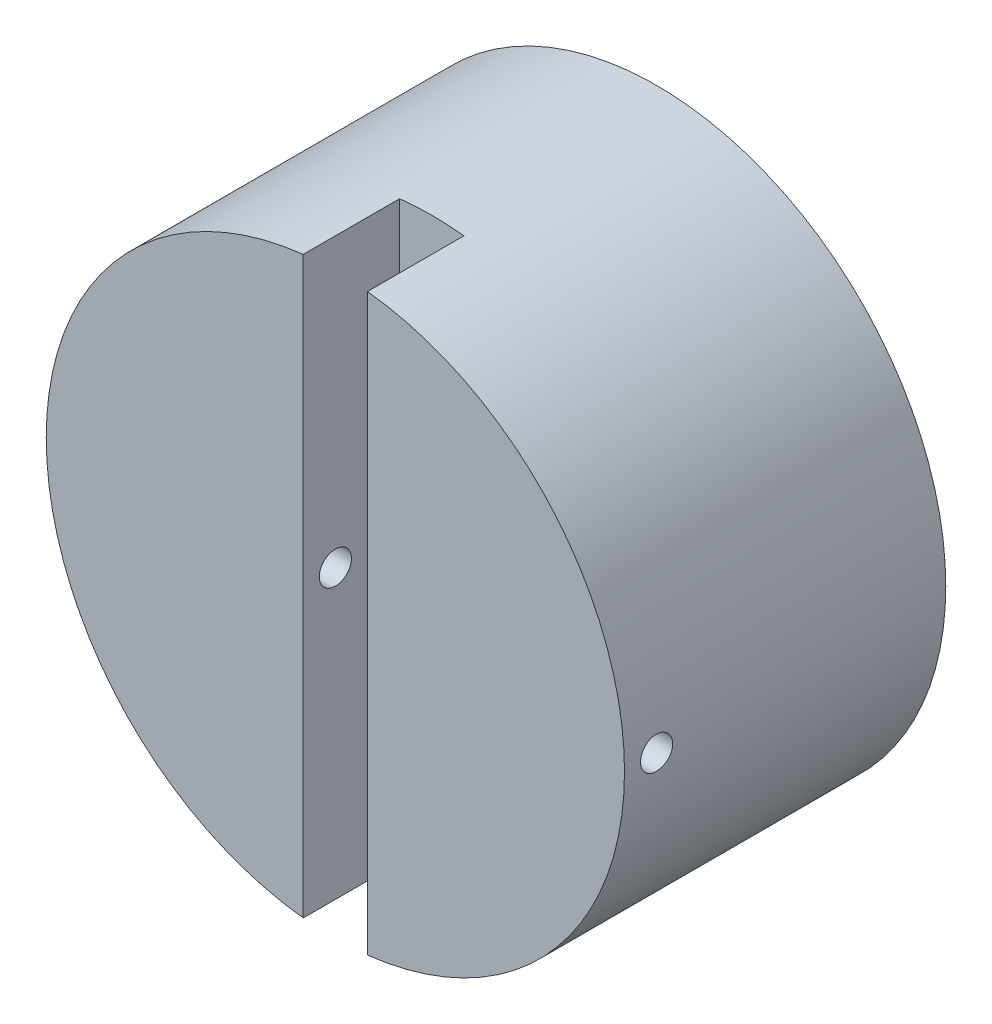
ISO-10303-21;
HEADER;
FILE_DESCRIPTION(('STEP AP214'),'2;1');
FILE_NAME('part.step','',(''),(''),'','','');
FILE_SCHEMA(('AUTOMOTIVE_DESIGN { 1 0 10303 214 1 1 1 1 }'));
ENDSEC;
DATA;
#1=APPLICATION_CONTEXT('core data for automotive mechanical design processes');
#2=APPLICATION_PROTOCOL_DEFINITION('international standard','automotive_design',2000,#1);
#3=PRODUCT_CONTEXT('',#1,'mechanical');
#4=PRODUCT('Part','Part','',(#3));
#5=PRODUCT_RELATED_PRODUCT_CATEGORY('part','',(#4));
#6=PRODUCT_DEFINITION_FORMATION('','',#4);
#7=PRODUCT_DEFINITION_CONTEXT('part definition',#1,'design');
#8=PRODUCT_DEFINITION('design','',#6,#7);
#9=PRODUCT_DEFINITION_SHAPE('','',#8);
#10=(LENGTH_UNIT() NAMED_UNIT(*) SI_UNIT(.MILLI.,.METRE.));
#11=(NAMED_UNIT(*) PLANE_ANGLE_UNIT() SI_UNIT($,.RADIAN.));
#12=(NAMED_UNIT(*) SI_UNIT($,.STERADIAN.) SOLID_ANGLE_UNIT());
#13=UNCERTAINTY_MEASURE_WITH_UNIT(LENGTH_MEASURE(1.E-05),#10,'distance_accuracy_value','');
#14=(GEOMETRIC_REPRESENTATION_CONTEXT(3) GLOBAL_UNCERTAINTY_ASSIGNED_CONTEXT((#13)) GLOBAL_UNIT_ASSIGNED_CONTEXT((#10,
#11,#12)) REPRESENTATION_CONTEXT('',''));
#15=CARTESIAN_POINT('',(0.,0.,0.));
#16=DIRECTION('',(0.,0.,1.));
#17=DIRECTION('',(1.,0.,0.));
#18=AXIS2_PLACEMENT_3D('',#15,#16,#17);
#19=CARTESIAN_POINT('',(0.,0.,100.));
#20=DIRECTION('',(0.,0.,-1.));
#21=DIRECTION('',(-1.,0.,0.));
#22=AXIS2_PLACEMENT_3D('',#19,#20,#21);
#23=CYLINDRICAL_SURFACE('',#22,90.);
#24=CARTESIAN_POINT('',(90.,0.,95.));
#25=CARTESIAN_POINT('',(90.00000017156,-0.140360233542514,95.0000011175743));
#26=CARTESIAN_POINT('',(89.999670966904,-0.280702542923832,94.9940873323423));
#27=CARTESIAN_POINT('',(89.9983637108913,-0.560434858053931,94.9704742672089));
#28=CARTESIAN_POINT('',(89.9973854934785,-0.699824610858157,94.952771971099));
#29=CARTESIAN_POINT('',(89.9948064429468,-0.976731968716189,94.9056841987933));
#30=CARTESIAN_POINT('',(89.993205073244,-1.11424785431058,94.8762886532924));
#31=CARTESIAN_POINT('',(89.9894245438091,-1.38635929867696,94.8060129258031));
#32=CARTESIAN_POINT('',(89.9872451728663,-1.52095377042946,94.7651285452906));
#33=CARTESIAN_POINT('',(89.9823729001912,-1.78609486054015,94.6722137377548));
#34=CARTESIAN_POINT('',(89.9796804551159,-1.91664495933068,94.6201932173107));
#35=CARTESIAN_POINT('',(89.9738559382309,-2.17294420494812,94.5053347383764));
#36=CARTESIAN_POINT('',(89.970723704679,-2.29869156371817,94.4424927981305));
#37=CARTESIAN_POINT('',(89.9641110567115,-2.54436938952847,94.3064934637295));
#38=CARTESIAN_POINT('',(89.9606308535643,-2.66430332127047,94.2333423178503));
#39=CARTESIAN_POINT('',(89.9534177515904,-2.89763110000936,94.0771862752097));
#40=CARTESIAN_POINT('',(89.9496847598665,-3.01102251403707,93.9941777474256));
#41=CARTESIAN_POINT('',(89.9420701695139,-3.23049240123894,93.8188556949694));
#42=CARTESIAN_POINT('',(89.9381884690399,-3.33656571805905,93.7265357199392));
#43=CARTESIAN_POINT('',(89.9303874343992,-3.54059957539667,93.53325749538));
#44=CARTESIAN_POINT('',(89.926468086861,-3.63855710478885,93.4322960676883));
#45=CARTESIAN_POINT('',(89.9187055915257,-3.82559084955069,93.2225138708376));
#46=CARTESIAN_POINT('',(89.9148624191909,-3.91466996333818,93.1136956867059));
#47=CARTESIAN_POINT('',(89.9073585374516,-4.08338293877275,92.8888995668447));
#48=CARTESIAN_POINT('',(89.903697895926,-4.16301330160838,92.7729190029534));
#49=CARTESIAN_POINT('',(89.8966636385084,-4.31224433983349,92.5346235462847));
#50=CARTESIAN_POINT('',(89.8932900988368,-4.38184235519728,92.4123069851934));
#51=CARTESIAN_POINT('',(89.8869258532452,-4.51051122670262,92.1621927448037));
#52=CARTESIAN_POINT('',(89.8839352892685,-4.56957818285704,92.0343930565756));
#53=CARTESIAN_POINT('',(89.8784248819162,-4.6767111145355,91.7742988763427));
#54=CARTESIAN_POINT('',(89.8759048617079,-4.72478122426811,91.6420060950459));
#55=CARTESIAN_POINT('',(89.8714044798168,-4.80961883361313,91.3738214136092));
#56=CARTESIAN_POINT('',(89.8694243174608,-4.8463821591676,91.2379282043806));
#57=CARTESIAN_POINT('',(89.8643907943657,-4.93916268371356,90.8266749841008));
#58=CARTESIAN_POINT('',(89.8622322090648,-4.9778995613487,90.5471835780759));
#59=CARTESIAN_POINT('',(89.8605656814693,-5.00788626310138,89.9858093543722));
#60=CARTESIAN_POINT('',(89.8610577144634,-4.99913652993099,89.7039265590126));
#61=CARTESIAN_POINT('',(89.8646301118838,-4.93450003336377,89.1459148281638));
#62=CARTESIAN_POINT('',(89.8677076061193,-4.87866553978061,88.8697798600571));
#63=CARTESIAN_POINT('',(89.8761007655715,-4.72150904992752,88.3308188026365));
#64=CARTESIAN_POINT('',(89.8814164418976,-4.62018682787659,88.0679927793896));
#65=CARTESIAN_POINT('',(89.8936898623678,-4.37487588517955,87.5629287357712));
#66=CARTESIAN_POINT('',(89.9006485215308,-4.23086337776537,87.320702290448));
#67=CARTESIAN_POINT('',(89.9154228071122,-3.90427595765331,86.8638434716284));
#68=CARTESIAN_POINT('',(89.9232384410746,-3.72170070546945,86.6492113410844));
#69=CARTESIAN_POINT('',(89.9388585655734,-3.32287594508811,86.2533285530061));
#70=CARTESIAN_POINT('',(89.9466630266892,-3.10658117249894,86.0721234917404));
#71=CARTESIAN_POINT('',(89.9613710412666,-2.64661601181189,85.7485903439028));
#72=CARTESIAN_POINT('',(89.9682745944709,-2.40294561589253,85.6062622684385));
#73=CARTESIAN_POINT('',(89.9804032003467,-1.89511905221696,85.3645273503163));
#74=CARTESIAN_POINT('',(89.9856281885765,-1.63096209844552,85.2651221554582));
#75=CARTESIAN_POINT('',(89.9938099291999,-1.08967290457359,85.1120848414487));
#76=CARTESIAN_POINT('',(89.9967667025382,-0.812540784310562,85.0584522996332));
#77=CARTESIAN_POINT('',(90.0000761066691,-0.253563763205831,84.9985390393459));
#78=CARTESIAN_POINT('',(90.0004322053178,0.0282743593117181,84.9921952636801));
#79=CARTESIAN_POINT('',(89.9985093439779,0.589010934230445,85.0268749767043));
#80=CARTESIAN_POINT('',(89.9962303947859,0.867909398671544,85.0678982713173));
#81=CARTESIAN_POINT('',(89.9892962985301,1.41467267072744,85.1960954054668));
#82=CARTESIAN_POINT('',(89.9846426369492,1.68254426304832,85.2832403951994));
#83=CARTESIAN_POINT('',(89.9734828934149,2.1998590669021,85.5011779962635));
#84=CARTESIAN_POINT('',(89.9669767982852,2.44930214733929,85.6319709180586));
#85=CARTESIAN_POINT('',(89.9528350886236,2.92296839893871,85.9336524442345));
#86=CARTESIAN_POINT('',(89.9451982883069,3.14716465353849,86.1045832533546));
#87=CARTESIAN_POINT('',(89.9296589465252,3.56370226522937,86.4816278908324));
#88=CARTESIAN_POINT('',(89.9217564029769,3.75604337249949,86.687741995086));
#89=CARTESIAN_POINT('',(89.9065662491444,4.10362407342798,87.1295702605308));
#90=CARTESIAN_POINT('',(89.8992793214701,4.25882282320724,87.3653165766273));
#91=CARTESIAN_POINT('',(89.8861531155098,4.52743255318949,87.8595691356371));
#92=CARTESIAN_POINT('',(89.880313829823,4.64084374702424,88.1180752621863));
#93=CARTESIAN_POINT('',(89.8707455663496,4.8225935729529,88.6503068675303));
#94=CARTESIAN_POINT('',(89.8670153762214,4.89095810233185,88.9240235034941));
#95=CARTESIAN_POINT('',(89.8620852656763,4.98073793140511,89.4792243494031));
#96=CARTESIAN_POINT('',(89.8608853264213,5.00215358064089,89.7607085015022));
#97=CARTESIAN_POINT('',(89.8610775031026,4.99866262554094,90.1821650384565));
#98=CARTESIAN_POINT('',(89.8614733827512,4.99156669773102,90.3225028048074));
#99=CARTESIAN_POINT('',(89.8629123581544,4.96560006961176,90.6020673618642));
#100=CARTESIAN_POINT('',(89.863955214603,4.94673372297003,90.7412945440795));
#101=CARTESIAN_POINT('',(89.8666600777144,4.89734707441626,91.017703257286));
#102=CARTESIAN_POINT('',(89.8683223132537,4.86682246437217,91.1548840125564));
#103=CARTESIAN_POINT('',(89.872217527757,4.79435436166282,91.4261356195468));
#104=CARTESIAN_POINT('',(89.8744502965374,4.75241507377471,91.5602075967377));
#105=CARTESIAN_POINT('',(89.8794244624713,4.65739412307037,91.8243885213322));
#106=CARTESIAN_POINT('',(89.8821660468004,4.60430835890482,91.9544959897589));
#107=CARTESIAN_POINT('',(89.8880783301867,4.48740416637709,92.2097282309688));
#108=CARTESIAN_POINT('',(89.8912488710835,4.42358969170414,92.3348548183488));
#109=CARTESIAN_POINT('',(89.8979311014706,4.28564477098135,92.579332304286));
#110=CARTESIAN_POINT('',(89.9014429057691,4.21151084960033,92.698681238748));
#111=CARTESIAN_POINT('',(89.9087059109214,4.05349867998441,92.9306719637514));
#112=CARTESIAN_POINT('',(89.912457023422,3.96962401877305,93.0433162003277));
#113=CARTESIAN_POINT('',(89.9200998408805,3.79255941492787,93.2613256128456));
#114=CARTESIAN_POINT('',(89.9239917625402,3.6993546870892,93.366678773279));
#115=CARTESIAN_POINT('',(89.9317986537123,3.50443971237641,93.5691230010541));
#116=CARTESIAN_POINT('',(89.9357136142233,3.40273260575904,93.6662170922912));
#117=CARTESIAN_POINT('',(89.9434594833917,3.19143798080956,93.8515561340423));
#118=CARTESIAN_POINT('',(89.9472903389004,3.08184565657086,93.9397956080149));
#119=CARTESIAN_POINT('',(89.9547554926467,2.85565429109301,94.1067001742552));
#120=CARTESIAN_POINT('',(89.9583898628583,2.73905784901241,94.1853687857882));
#121=CARTESIAN_POINT('',(89.965365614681,2.49947389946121,94.33271698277));
#122=CARTESIAN_POINT('',(89.9687065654,2.37647740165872,94.40138197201));
#123=CARTESIAN_POINT('',(89.974993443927,2.12516973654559,94.5280733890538));
#124=CARTESIAN_POINT('',(89.9779395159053,1.99686053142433,94.586103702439));
#125=CARTESIAN_POINT('',(89.9833519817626,1.73590822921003,94.6910961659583));
#126=CARTESIAN_POINT('',(89.9858187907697,1.603269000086,94.7380679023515));
#127=CARTESIAN_POINT('',(89.9902053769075,1.33454052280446,94.8206597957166));
#128=CARTESIAN_POINT('',(89.9921252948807,1.19845217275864,94.8562828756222));
#129=CARTESIAN_POINT('',(89.995797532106,0.886966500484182,94.9239235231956));
#130=CARTESIAN_POINT('',(89.9973676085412,0.710792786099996,94.9524270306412));
#131=CARTESIAN_POINT('',(89.9994687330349,0.356403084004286,94.9904645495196));
#132=CARTESIAN_POINT('',(89.9999997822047,0.17818709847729,94.9999985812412));
#133=CARTESIAN_POINT('',(90.,0.,95.));
#134=B_SPLINE_CURVE_WITH_KNOTS('',3,(#24,#25,#26,#27,#28,#29,#30,#31,#32,#33,#34,#35,#36,#37,
#38,#39,#40,#41,#42,#43,#44,#45,#46,#47,#48,#49,#50,#51,#52,#53,#54,#55,#56,#57,#58,#59,#60,#61,
#62,#63,#64,#65,#66,#67,#68,#69,#70,#71,#72,#73,#74,#75,#76,#77,#78,#79,#80,#81,#82,#83,#84,#85,
#86,#87,#88,#89,#90,#91,#92,#93,#94,#95,#96,#97,#98,#99,#100,#101,#102,#103,#104,#105,#106,#107,
#108,#109,#110,#111,#112,#113,#114,#115,#116,#117,#118,#119,#120,#121,#122,#123,#124,#125,#126,
#127,#128,#129,#130,#131,#132,#133),.UNSPECIFIED.,.T.,.F.,(4,2,2,2,2,2,2,2,2,2,2,2,2,2,2,2,2,2,
2,2,2,2,2,2,2,2,2,2,2,2,2,2,2,2,2,2,2,2,2,2,2,2,2,2,2,2,2,2,2,2,2,2,2,2,4),(0.,
0.420925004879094,0.841957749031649,1.26335384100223,1.68490413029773,2.10608096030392,
2.52741309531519,2.94849095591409,3.36972440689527,3.79125169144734,4.21293467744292,
4.63447954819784,5.05618003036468,5.47799211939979,5.89996009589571,6.32176917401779,
6.7437337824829,7.58587641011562,8.42801118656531,9.26921231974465,10.110417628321,
10.9520925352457,11.7937748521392,12.6365969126,13.4794192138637,14.3222738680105,
15.1651207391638,16.0068435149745,16.8485628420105,17.6897562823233,18.5309557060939,
19.3730436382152,20.215138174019,21.0581545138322,21.9011665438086,22.7436935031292,
23.5862141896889,24.0073574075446,24.4283449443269,24.8494882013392,25.2704765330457,
25.69162003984,26.1126086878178,26.5337394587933,26.954715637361,27.3763698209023,
27.7978689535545,28.2196271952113,28.6412298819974,29.0634416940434,29.4854989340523,
29.9071889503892,30.3287702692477,30.8631344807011,31.3974981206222),.UNSPECIFIED.);
#135=CARTESIAN_POINT('',(90.,0.,95.));
#136=VERTEX_POINT('',#135);
#137=EDGE_CURVE('E117',#136,#136,#134,.T.);
#138=ORIENTED_EDGE('',*,*,#137,.F.);
#139=EDGE_LOOP('',(#138));
#140=FACE_BOUND('',#139,.T.);
#141=CARTESIAN_POINT('',(0.,0.,0.));
#142=DIRECTION('',(0.,0.,1.));
#143=DIRECTION('',(1.,0.,0.));
#144=AXIS2_PLACEMENT_3D('',#141,#142,#143);
#145=CIRCLE('',#144,90.);
#146=CARTESIAN_POINT('',(90.,0.,0.));
#147=VERTEX_POINT('',#146);
#148=EDGE_CURVE('E98',#147,#147,#145,.T.);
#149=ORIENTED_EDGE('',*,*,#148,.T.);
#150=EDGE_LOOP('',(#149));
#151=FACE_BOUND('',#150,.T.);
#152=DIRECTION('',(0.,0.,-1.));
#153=VECTOR('',#152,1.);
#154=CARTESIAN_POINT('',(10.,-89.4427190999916,100.));
#155=LINE('',#154,#153);
#156=CARTESIAN_POINT('',(10.,-89.4427190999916,70.));
#157=VERTEX_POINT('',#156);
#158=CARTESIAN_POINT('',(10.,-89.4427190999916,100.));
#159=VERTEX_POINT('',#158);
#160=EDGE_CURVE('E54',#157,#159,#155,.F.);
#161=ORIENTED_EDGE('',*,*,#160,.F.);
#162=CARTESIAN_POINT('',(0.,0.,70.));
#163=DIRECTION('',(0.,0.,1.));
#164=DIRECTION('',(1.,0.,0.));
#165=AXIS2_PLACEMENT_3D('',#162,#163,#164);
#166=CIRCLE('',#165,90.);
#167=CARTESIAN_POINT('',(-10.,-89.4427190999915,70.));
#168=VERTEX_POINT('',#167);
#169=EDGE_CURVE('E11',#168,#157,#166,.T.);
#170=ORIENTED_EDGE('',*,*,#169,.F.);
#171=DIRECTION('',(0.,0.,-1.));
#172=VECTOR('',#171,1.);
#173=CARTESIAN_POINT('',(-9.99999999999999,-89.4427190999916,100.));
#174=LINE('',#173,#172);
#175=CARTESIAN_POINT('',(-10.,-89.4427190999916,100.));
#176=VERTEX_POINT('',#175);
#177=EDGE_CURVE('E84',#176,#168,#174,.T.);
#178=ORIENTED_EDGE('',*,*,#177,.F.);
#179=CARTESIAN_POINT('',(0.,0.,100.));
#180=DIRECTION('',(0.,0.,1.));
#181=DIRECTION('',(1.,0.,0.));
#182=AXIS2_PLACEMENT_3D('',#179,#180,#181);
#183=CIRCLE('',#182,90.);
#184=CARTESIAN_POINT('',(-10.,89.4427190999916,100.));
#185=VERTEX_POINT('',#184);
#186=EDGE_CURVE('E90',#185,#176,#183,.T.);
#187=ORIENTED_EDGE('',*,*,#186,.F.);
#188=DIRECTION('',(0.,0.,-1.));
#189=VECTOR('',#188,1.);
#190=CARTESIAN_POINT('',(-9.99999999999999,89.4427190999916,100.));
#191=LINE('',#190,#189);
#192=CARTESIAN_POINT('',(-10.,89.4427190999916,70.));
#193=VERTEX_POINT('',#192);
#194=EDGE_CURVE('E46',#193,#185,#191,.F.);
#195=ORIENTED_EDGE('',*,*,#194,.F.);
#196=CARTESIAN_POINT('',(10.,89.4427190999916,70.));
#197=VERTEX_POINT('',#196);
#198=EDGE_CURVE('E39',#197,#193,#166,.T.);
#199=ORIENTED_EDGE('',*,*,#198,.F.);
#200=DIRECTION('',(0.,0.,-1.));
#201=VECTOR('',#200,1.);
#202=CARTESIAN_POINT('',(10.,89.4427190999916,100.));
#203=LINE('',#202,#201);
#204=CARTESIAN_POINT('',(10.,89.4427190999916,100.));
#205=VERTEX_POINT('',#204);
#206=EDGE_CURVE('E96',#205,#197,#203,.T.);
#207=ORIENTED_EDGE('',*,*,#206,.F.);
#208=EDGE_CURVE('E99',#159,#205,#183,.T.);
#209=ORIENTED_EDGE('',*,*,#208,.F.);
#210=EDGE_LOOP('',(#161,#170,#178,#187,#195,#199,#207,#209));
#211=FACE_BOUND('',#210,.T.);
#212=CARTESIAN_POINT('',(-90.,0.,95.));
#213=CARTESIAN_POINT('',(-90.0000001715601,0.140360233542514,95.0000011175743));
#214=CARTESIAN_POINT('',(-89.999670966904,0.280702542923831,94.9940873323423));
#215=CARTESIAN_POINT('',(-89.9983637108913,0.560434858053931,94.9704742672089));
#216=CARTESIAN_POINT('',(-89.9973854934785,0.699824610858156,94.952771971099));
#217=CARTESIAN_POINT('',(-89.9948064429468,0.976731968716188,94.9056841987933));
#218=CARTESIAN_POINT('',(-89.993205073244,1.11424785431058,94.8762886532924));
#219=CARTESIAN_POINT('',(-89.9894245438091,1.38635929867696,94.8060129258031));
#220=CARTESIAN_POINT('',(-89.9872451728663,1.52095377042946,94.7651285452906));
#221=CARTESIAN_POINT('',(-89.9823729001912,1.78609486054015,94.6722137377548));
#222=CARTESIAN_POINT('',(-89.9796804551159,1.91664495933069,94.6201932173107));
#223=CARTESIAN_POINT('',(-89.9738559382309,2.17294420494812,94.5053347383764));
#224=CARTESIAN_POINT('',(-89.970723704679,2.29869156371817,94.4424927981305));
#225=CARTESIAN_POINT('',(-89.9641110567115,2.54436938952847,94.3064934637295));
#226=CARTESIAN_POINT('',(-89.9606308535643,2.66430332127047,94.2333423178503));
#227=CARTESIAN_POINT('',(-89.9534177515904,2.89763110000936,94.0771862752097));
#228=CARTESIAN_POINT('',(-89.9496847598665,3.01102251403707,93.9941777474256));
#229=CARTESIAN_POINT('',(-89.9420701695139,3.23049240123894,93.8188556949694));
#230=CARTESIAN_POINT('',(-89.9381884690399,3.33656571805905,93.7265357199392));
#231=CARTESIAN_POINT('',(-89.9303874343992,3.54059957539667,93.53325749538));
#232=CARTESIAN_POINT('',(-89.926468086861,3.63855710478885,93.4322960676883));
#233=CARTESIAN_POINT('',(-89.9187055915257,3.82559084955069,93.2225138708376));
#234=CARTESIAN_POINT('',(-89.9148624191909,3.91466996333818,93.1136956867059));
#235=CARTESIAN_POINT('',(-89.9073585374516,4.08338293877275,92.8888995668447));
#236=CARTESIAN_POINT('',(-89.903697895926,4.16301330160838,92.7729190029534));
#237=CARTESIAN_POINT('',(-89.8966636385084,4.31224433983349,92.5346235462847));
#238=CARTESIAN_POINT('',(-89.8932900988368,4.38184235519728,92.4123069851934));
#239=CARTESIAN_POINT('',(-89.8869258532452,4.51051122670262,92.1621927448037));
#240=CARTESIAN_POINT('',(-89.8839352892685,4.56957818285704,92.0343930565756));
#241=CARTESIAN_POINT('',(-89.8784248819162,4.6767111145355,91.7742988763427));
#242=CARTESIAN_POINT('',(-89.8759048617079,4.72478122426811,91.6420060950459));
#243=CARTESIAN_POINT('',(-89.8714044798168,4.80961883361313,91.3738214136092));
#244=CARTESIAN_POINT('',(-89.8694243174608,4.8463821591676,91.2379282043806));
#245=CARTESIAN_POINT('',(-89.8643907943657,4.93916268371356,90.8266749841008));
#246=CARTESIAN_POINT('',(-89.8622322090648,4.9778995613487,90.5471835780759));
#247=CARTESIAN_POINT('',(-89.8605656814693,5.00788626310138,89.9858093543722));
#248=CARTESIAN_POINT('',(-89.8610577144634,4.99913652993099,89.7039265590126));
#249=CARTESIAN_POINT('',(-89.8646301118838,4.93450003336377,89.1459148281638));
#250=CARTESIAN_POINT('',(-89.8677076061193,4.87866553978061,88.8697798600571));
#251=CARTESIAN_POINT('',(-89.8761007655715,4.72150904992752,88.3308188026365));
#252=CARTESIAN_POINT('',(-89.8814164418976,4.62018682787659,88.0679927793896));
#253=CARTESIAN_POINT('',(-89.8936898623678,4.37487588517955,87.5629287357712));
#254=CARTESIAN_POINT('',(-89.9006485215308,4.23086337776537,87.320702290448));
#255=CARTESIAN_POINT('',(-89.9154228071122,3.90427595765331,86.8638434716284));
#256=CARTESIAN_POINT('',(-89.9232384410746,3.72170070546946,86.6492113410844));
#257=CARTESIAN_POINT('',(-89.9388585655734,3.32287594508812,86.2533285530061));
#258=CARTESIAN_POINT('',(-89.9466630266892,3.10658117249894,86.0721234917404));
#259=CARTESIAN_POINT('',(-89.9613710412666,2.64661601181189,85.7485903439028));
#260=CARTESIAN_POINT('',(-89.9682745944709,2.40294561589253,85.6062622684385));
#261=CARTESIAN_POINT('',(-89.9804032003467,1.89511905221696,85.3645273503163));
#262=CARTESIAN_POINT('',(-89.9856281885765,1.63096209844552,85.2651221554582));
#263=CARTESIAN_POINT('',(-89.9938099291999,1.08967290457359,85.1120848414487));
#264=CARTESIAN_POINT('',(-89.9967667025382,0.812540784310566,85.0584522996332));
#265=CARTESIAN_POINT('',(-90.0000761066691,0.253563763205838,84.9985390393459));
#266=CARTESIAN_POINT('',(-90.0004322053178,-0.0282743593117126,84.9921952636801));
#267=CARTESIAN_POINT('',(-89.9985093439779,-0.589010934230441,85.0268749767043));
#268=CARTESIAN_POINT('',(-89.9962303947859,-0.867909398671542,85.0678982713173));
#269=CARTESIAN_POINT('',(-89.9892962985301,-1.41467267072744,85.1960954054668));
#270=CARTESIAN_POINT('',(-89.9846426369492,-1.68254426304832,85.2832403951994));
#271=CARTESIAN_POINT('',(-89.9734828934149,-2.1998590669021,85.5011779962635));
#272=CARTESIAN_POINT('',(-89.9669767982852,-2.44930214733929,85.6319709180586));
#273=CARTESIAN_POINT('',(-89.9528350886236,-2.92296839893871,85.9336524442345));
#274=CARTESIAN_POINT('',(-89.9451982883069,-3.14716465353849,86.1045832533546));
#275=CARTESIAN_POINT('',(-89.9296589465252,-3.56370226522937,86.4816278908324));
#276=CARTESIAN_POINT('',(-89.9217564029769,-3.75604337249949,86.687741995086));
#277=CARTESIAN_POINT('',(-89.9065662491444,-4.10362407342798,87.1295702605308));
#278=CARTESIAN_POINT('',(-89.8992793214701,-4.25882282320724,87.3653165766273));
#279=CARTESIAN_POINT('',(-89.8861531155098,-4.52743255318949,87.8595691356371));
#280=CARTESIAN_POINT('',(-89.880313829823,-4.64084374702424,88.1180752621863));
#281=CARTESIAN_POINT('',(-89.8707455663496,-4.8225935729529,88.6503068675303));
#282=CARTESIAN_POINT('',(-89.8670153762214,-4.89095810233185,88.9240235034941));
#283=CARTESIAN_POINT('',(-89.8620852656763,-4.98073793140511,89.4792243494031));
#284=CARTESIAN_POINT('',(-89.8608853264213,-5.00215358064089,89.7607085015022));
#285=CARTESIAN_POINT('',(-89.8610775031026,-4.99866262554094,90.1821650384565));
#286=CARTESIAN_POINT('',(-89.8614733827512,-4.99156669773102,90.3225028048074));
#287=CARTESIAN_POINT('',(-89.8629123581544,-4.96560006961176,90.6020673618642));
#288=CARTESIAN_POINT('',(-89.863955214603,-4.94673372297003,90.7412945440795));
#289=CARTESIAN_POINT('',(-89.8666600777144,-4.89734707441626,91.017703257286));
#290=CARTESIAN_POINT('',(-89.8683223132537,-4.86682246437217,91.1548840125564));
#291=CARTESIAN_POINT('',(-89.872217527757,-4.79435436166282,91.4261356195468));
#292=CARTESIAN_POINT('',(-89.8744502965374,-4.75241507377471,91.5602075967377));
#293=CARTESIAN_POINT('',(-89.8794244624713,-4.65739412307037,91.8243885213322));
#294=CARTESIAN_POINT('',(-89.8821660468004,-4.60430835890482,91.9544959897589));
#295=CARTESIAN_POINT('',(-89.8880783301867,-4.48740416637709,92.2097282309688));
#296=CARTESIAN_POINT('',(-89.8912488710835,-4.42358969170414,92.3348548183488));
#297=CARTESIAN_POINT('',(-89.8979311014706,-4.28564477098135,92.579332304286));
#298=CARTESIAN_POINT('',(-89.9014429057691,-4.21151084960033,92.698681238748));
#299=CARTESIAN_POINT('',(-89.9087059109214,-4.05349867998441,92.9306719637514));
#300=CARTESIAN_POINT('',(-89.912457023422,-3.96962401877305,93.0433162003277));
#301=CARTESIAN_POINT('',(-89.9200998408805,-3.79255941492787,93.2613256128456));
#302=CARTESIAN_POINT('',(-89.9239917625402,-3.6993546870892,93.366678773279));
#303=CARTESIAN_POINT('',(-89.9317986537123,-3.50443971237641,93.5691230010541));
#304=CARTESIAN_POINT('',(-89.9357136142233,-3.40273260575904,93.6662170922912));
#305=CARTESIAN_POINT('',(-89.9434594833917,-3.19143798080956,93.8515561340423));
#306=CARTESIAN_POINT('',(-89.9472903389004,-3.08184565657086,93.9397956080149));
#307=CARTESIAN_POINT('',(-89.9547554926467,-2.85565429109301,94.1067001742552));
#308=CARTESIAN_POINT('',(-89.9583898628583,-2.73905784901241,94.1853687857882));
#309=CARTESIAN_POINT('',(-89.965365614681,-2.49947389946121,94.33271698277));
#310=CARTESIAN_POINT('',(-89.9687065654,-2.37647740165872,94.40138197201));
#311=CARTESIAN_POINT('',(-89.974993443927,-2.12516973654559,94.5280733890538));
#312=CARTESIAN_POINT('',(-89.9779395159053,-1.99686053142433,94.586103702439));
#313=CARTESIAN_POINT('',(-89.9833519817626,-1.73590822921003,94.6910961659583));
#314=CARTESIAN_POINT('',(-89.9858187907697,-1.603269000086,94.7380679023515));
#315=CARTESIAN_POINT('',(-89.9902053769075,-1.33454052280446,94.8206597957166));
#316=CARTESIAN_POINT('',(-89.9921252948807,-1.19845217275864,94.8562828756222));
#317=CARTESIAN_POINT('',(-89.995797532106,-0.886966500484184,94.9239235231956));
#318=CARTESIAN_POINT('',(-89.9973676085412,-0.710792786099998,94.9524270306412));
#319=CARTESIAN_POINT('',(-89.999468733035,-0.356403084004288,94.9904645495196));
#320=CARTESIAN_POINT('',(-89.9999997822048,-0.178187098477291,94.9999985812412));
#321=CARTESIAN_POINT('',(-90.,0.,95.));
#322=B_SPLINE_CURVE_WITH_KNOTS('',3,(#212,#213,#214,#215,#216,#217,#218,#219,#220,#221,#222,
#223,#224,#225,#226,#227,#228,#229,#230,#231,#232,#233,#234,#235,#236,#237,#238,#239,#240,#241,
#242,#243,#244,#245,#246,#247,#248,#249,#250,#251,#252,#253,#254,#255,#256,#257,#258,#259,#260,
#261,#262,#263,#264,#265,#266,#267,#268,#269,#270,#271,#272,#273,#274,#275,#276,#277,#278,#279,
#280,#281,#282,#283,#284,#285,#286,#287,#288,#289,#290,#291,#292,#293,#294,#295,#296,#297,#298,
#299,#300,#301,#302,#303,#304,#305,#306,#307,#308,#309,#310,#311,#312,#313,#314,#315,#316,#317,
#318,#319,#320,#321),.UNSPECIFIED.,.T.,.F.,(4,2,2,2,2,2,2,2,2,2,2,2,2,2,2,2,2,2,2,2,2,2,2,2,2,2,
2,2,2,2,2,2,2,2,2,2,2,2,2,2,2,2,2,2,2,2,2,2,2,2,2,2,2,2,4),(0.,0.420925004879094,
0.841957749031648,1.26335384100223,1.68490413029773,2.10608096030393,2.52741309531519,
2.94849095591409,3.36972440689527,3.79125169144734,4.21293467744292,4.63447954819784,
5.05618003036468,5.47799211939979,5.89996009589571,6.32176917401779,6.7437337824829,
7.58587641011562,8.42801118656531,9.26921231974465,10.110417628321,10.9520925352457,
11.7937748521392,12.6365969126,13.4794192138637,14.3222738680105,15.1651207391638,
16.0068435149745,16.8485628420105,17.6897562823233,18.5309557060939,19.3730436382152,
20.215138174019,21.0581545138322,21.9011665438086,22.7436935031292,23.5862141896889,
24.0073574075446,24.4283449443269,24.8494882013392,25.2704765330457,25.69162003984,
26.1126086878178,26.5337394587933,26.954715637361,27.3763698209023,27.7978689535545,
28.2196271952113,28.6412298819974,29.0634416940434,29.4854989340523,29.9071889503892,
30.3287702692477,30.8631344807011,31.3974981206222),.UNSPECIFIED.);
#323=CARTESIAN_POINT('',(-90.,0.,95.));
#324=VERTEX_POINT('',#323);
#325=EDGE_CURVE('E85',#324,#324,#322,.T.);
#326=ORIENTED_EDGE('',*,*,#325,.F.);
#327=EDGE_LOOP('',(#326));
#328=FACE_BOUND('',#327,.T.);
#329=ADVANCED_FACE('F30',(#140,#151,#211,#328),#23,.T.);
#330=CARTESIAN_POINT('',(10.,100.,130.));
#331=DIRECTION('',(-1.,0.,0.));
#332=DIRECTION('',(0.,0.,1.));
#333=AXIS2_PLACEMENT_3D('',#330,#331,#332);
#334=PLANE('',#333);
#335=ORIENTED_EDGE('',*,*,#206,.T.);
#336=DIRECTION('',(0.,-1.,0.));
#337=VECTOR('',#336,1.);
#338=CARTESIAN_POINT('',(10.,100.,70.));
#339=LINE('',#338,#337);
#340=EDGE_CURVE('E77',#197,#157,#339,.T.);
#341=ORIENTED_EDGE('',*,*,#340,.T.);
#342=ORIENTED_EDGE('',*,*,#160,.T.);
#343=DIRECTION('',(0.,-1.,0.));
#344=VECTOR('',#343,1.);
#345=CARTESIAN_POINT('',(10.,0.,100.));
#346=LINE('',#345,#344);
#347=EDGE_CURVE('E80',#205,#159,#346,.T.);
#348=ORIENTED_EDGE('',*,*,#347,.F.);
#349=EDGE_LOOP('',(#335,#341,#342,#348));
#350=FACE_BOUND('',#349,.T.);
#351=CARTESIAN_POINT('',(10.,0.,90.));
#352=DIRECTION('',(-1.,0.,0.));
#353=DIRECTION('',(0.,0.,1.));
#354=AXIS2_PLACEMENT_3D('',#351,#352,#353);
#355=CIRCLE('',#354,5.);
#356=CARTESIAN_POINT('',(10.,0.,95.));
#357=VERTEX_POINT('',#356);
#358=EDGE_CURVE('E115',#357,#357,#355,.F.);
#359=ORIENTED_EDGE('',*,*,#358,.T.);
#360=EDGE_LOOP('',(#359));
#361=FACE_BOUND('',#360,.T.);
#362=ADVANCED_FACE('F109',(#350,#361),#334,.T.);
#363=CARTESIAN_POINT('',(-10.,100.,130.));
#364=DIRECTION('',(1.,0.,0.));
#365=DIRECTION('',(0.,0.,-1.));
#366=AXIS2_PLACEMENT_3D('',#363,#364,#365);
#367=PLANE('',#366);
#368=ORIENTED_EDGE('',*,*,#177,.T.);
#369=DIRECTION('',(0.,-1.,0.));
#370=VECTOR('',#369,1.);
#371=CARTESIAN_POINT('',(-10.,100.,70.));
#372=LINE('',#371,#370);
#373=EDGE_CURVE('E75',#193,#168,#372,.T.);
#374=ORIENTED_EDGE('',*,*,#373,.F.);
#375=ORIENTED_EDGE('',*,*,#194,.T.);
#376=DIRECTION('',(0.,1.,0.));
#377=VECTOR('',#376,1.);
#378=CARTESIAN_POINT('',(-10.,0.,100.));
#379=LINE('',#378,#377);
#380=EDGE_CURVE('E104',#176,#185,#379,.T.);
#381=ORIENTED_EDGE('',*,*,#380,.F.);
#382=EDGE_LOOP('',(#368,#374,#375,#381));
#383=FACE_BOUND('',#382,.T.);
#384=CARTESIAN_POINT('',(-10.,0.,90.));
#385=DIRECTION('',(1.,0.,0.));
#386=DIRECTION('',(0.,0.,-1.));
#387=AXIS2_PLACEMENT_3D('',#384,#385,#386);
#388=CIRCLE('',#387,5.);
#389=CARTESIAN_POINT('',(-10.,0.,85.));
#390=VERTEX_POINT('',#389);
#391=EDGE_CURVE('E34',#390,#390,#388,.F.);
#392=ORIENTED_EDGE('',*,*,#391,.T.);
#393=EDGE_LOOP('',(#392));
#394=FACE_BOUND('',#393,.T.);
#395=ADVANCED_FACE('F81',(#383,#394),#367,.T.);
#396=CARTESIAN_POINT('',(0.,0.,100.));
#397=DIRECTION('',(0.,0.,1.));
#398=DIRECTION('',(1.,0.,0.));
#399=AXIS2_PLACEMENT_3D('',#396,#397,#398);
#400=PLANE('',#399);
#401=ORIENTED_EDGE('',*,*,#208,.T.);
#402=ORIENTED_EDGE('',*,*,#347,.T.);
#403=EDGE_LOOP('',(#401,#402));
#404=FACE_BOUND('',#403,.T.);
#405=ADVANCED_FACE('F108',(#404),#400,.T.);
#406=ORIENTED_EDGE('',*,*,#186,.T.);
#407=ORIENTED_EDGE('',*,*,#380,.T.);
#408=EDGE_LOOP('',(#406,#407));
#409=FACE_BOUND('',#408,.T.);
#410=ADVANCED_FACE('F141',(#409),#400,.T.);
#411=CARTESIAN_POINT('',(0.,0.,0.));
#412=DIRECTION('',(0.,0.,1.));
#413=DIRECTION('',(1.,0.,0.));
#414=AXIS2_PLACEMENT_3D('',#411,#412,#413);
#415=PLANE('',#414);
#416=ORIENTED_EDGE('',*,*,#148,.F.);
#417=EDGE_LOOP('',(#416));
#418=FACE_BOUND('',#417,.T.);
#419=ADVANCED_FACE('F138',(#418),#415,.F.);
#420=CARTESIAN_POINT('',(-10.,100.,70.));
#421=DIRECTION('',(0.,0.,1.));
#422=DIRECTION('',(1.,0.,0.));
#423=AXIS2_PLACEMENT_3D('',#420,#421,#422);
#424=PLANE('',#423);
#425=ORIENTED_EDGE('',*,*,#198,.T.);
#426=ORIENTED_EDGE('',*,*,#373,.T.);
#427=ORIENTED_EDGE('',*,*,#169,.T.);
#428=ORIENTED_EDGE('',*,*,#340,.F.);
#429=EDGE_LOOP('',(#425,#426,#427,#428));
#430=FACE_BOUND('',#429,.T.);
#431=ADVANCED_FACE('F74',(#430),#424,.T.);
#432=CARTESIAN_POINT('',(200.,0.,90.));
#433=DIRECTION('',(-1.,0.,0.));
#434=DIRECTION('',(0.,0.,1.));
#435=AXIS2_PLACEMENT_3D('',#432,#433,#434);
#436=CYLINDRICAL_SURFACE('',#435,5.);
#437=ORIENTED_EDGE('',*,*,#391,.F.);
#438=EDGE_LOOP('',(#437));
#439=FACE_BOUND('',#438,.T.);
#440=ORIENTED_EDGE('',*,*,#325,.T.);
#441=EDGE_LOOP('',(#440));
#442=FACE_BOUND('',#441,.T.);
#443=ADVANCED_FACE('F128',(#439,#442),#436,.F.);
#444=ORIENTED_EDGE('',*,*,#358,.F.);
#445=EDGE_LOOP('',(#444));
#446=FACE_BOUND('',#445,.T.);
#447=ORIENTED_EDGE('',*,*,#137,.T.);
#448=EDGE_LOOP('',(#447));
#449=FACE_BOUND('',#448,.T.);
#450=ADVANCED_FACE('F132',(#446,#449),#436,.F.);
#451=CLOSED_SHELL('',(#329,#362,#395,#405,#410,#419,#431,#443,#450));
#452=MANIFOLD_SOLID_BREP('B2',#451);
#453=ADVANCED_BREP_SHAPE_REPRESENTATION('',(#18,#452),#14);
#454=SHAPE_DEFINITION_REPRESENTATION(#9,#453);
ENDSEC;
END-ISO-10303-21;
